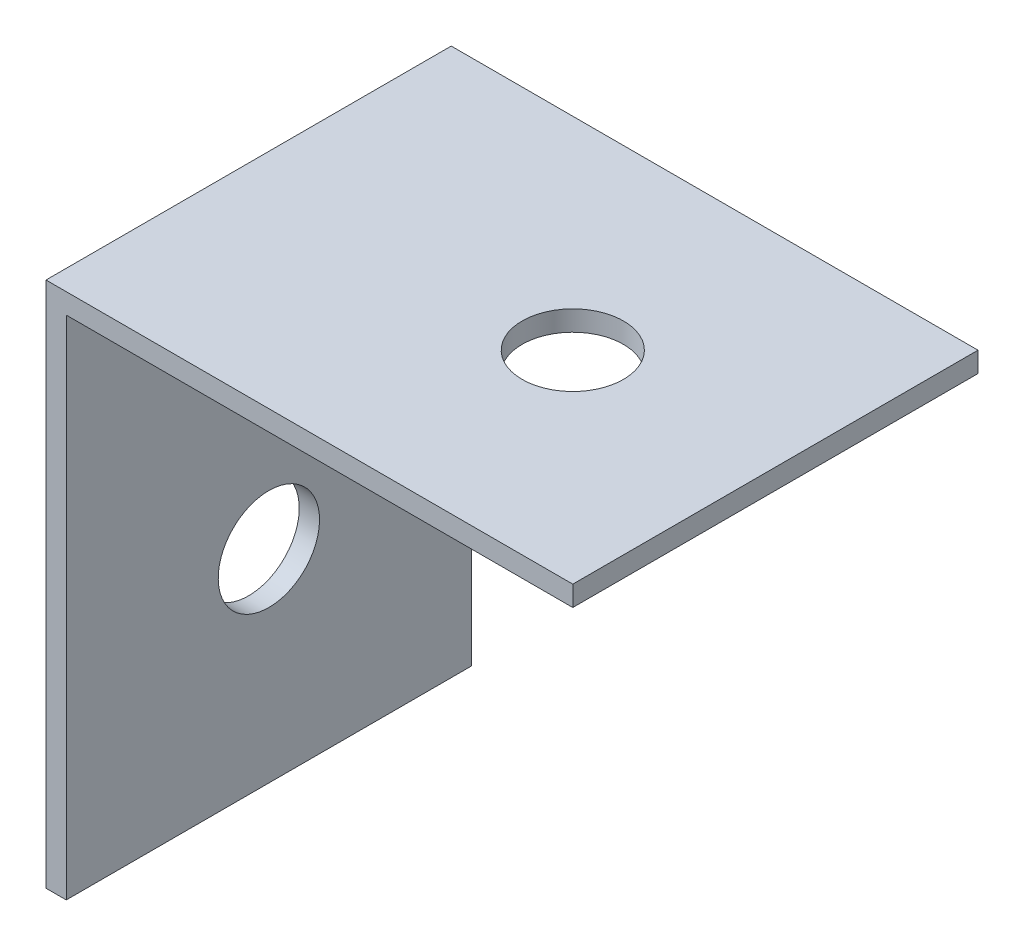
ISO-10303-21;
HEADER;
FILE_DESCRIPTION(('STEP AP214'),'2;1');
FILE_NAME('part.step','',(''),(''),'','','');
FILE_SCHEMA(('AUTOMOTIVE_DESIGN { 1 0 10303 214 1 1 1 1 }'));
ENDSEC;
DATA;
#1=APPLICATION_CONTEXT('core data for automotive mechanical design processes');
#2=APPLICATION_PROTOCOL_DEFINITION('international standard','automotive_design',2000,#1);
#3=PRODUCT_CONTEXT('',#1,'mechanical');
#4=PRODUCT('Part','Part','',(#3));
#5=PRODUCT_RELATED_PRODUCT_CATEGORY('part','',(#4));
#6=PRODUCT_DEFINITION_FORMATION('','',#4);
#7=PRODUCT_DEFINITION_CONTEXT('part definition',#1,'design');
#8=PRODUCT_DEFINITION('design','',#6,#7);
#9=PRODUCT_DEFINITION_SHAPE('','',#8);
#10=(LENGTH_UNIT() NAMED_UNIT(*) SI_UNIT(.MILLI.,.METRE.));
#11=(NAMED_UNIT(*) PLANE_ANGLE_UNIT() SI_UNIT($,.RADIAN.));
#12=(NAMED_UNIT(*) SI_UNIT($,.STERADIAN.) SOLID_ANGLE_UNIT());
#13=UNCERTAINTY_MEASURE_WITH_UNIT(LENGTH_MEASURE(1.E-05),#10,'distance_accuracy_value','');
#14=(GEOMETRIC_REPRESENTATION_CONTEXT(3) GLOBAL_UNCERTAINTY_ASSIGNED_CONTEXT((#13)) GLOBAL_UNIT_ASSIGNED_CONTEXT((#10,
#11,#12)) REPRESENTATION_CONTEXT('',''));
#15=CARTESIAN_POINT('',(0.,0.,0.));
#16=DIRECTION('',(0.,0.,1.));
#17=DIRECTION('',(1.,0.,0.));
#18=AXIS2_PLACEMENT_3D('',#15,#16,#17);
#19=CARTESIAN_POINT('',(-1.,0.,10.));
#20=DIRECTION('',(1.,0.,0.));
#21=DIRECTION('',(0.,1.,0.));
#22=AXIS2_PLACEMENT_3D('',#19,#20,#21);
#23=PLANE('',#22);
#24=CARTESIAN_POINT('',(-0.999999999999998,-15.,0.));
#25=DIRECTION('',(1.,0.,0.));
#26=DIRECTION('',(0.,1.,0.));
#27=AXIS2_PLACEMENT_3D('',#24,#25,#26);
#28=CIRCLE('',#27,2.5);
#29=CARTESIAN_POINT('',(-0.999999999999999,-12.5,0.));
#30=VERTEX_POINT('',#29);
#31=EDGE_CURVE('E164',#30,#30,#28,.F.);
#32=ORIENTED_EDGE('',*,*,#31,.F.);
#33=EDGE_LOOP('',(#32));
#34=FACE_BOUND('',#33,.T.);
#35=DIRECTION('',(0.,0.,-1.));
#36=VECTOR('',#35,1.);
#37=CARTESIAN_POINT('',(-1.,1.,10.));
#38=LINE('',#37,#36);
#39=CARTESIAN_POINT('',(-1.,1.,10.));
#40=VERTEX_POINT('',#39);
#41=CARTESIAN_POINT('',(-1.,1.,-10.));
#42=VERTEX_POINT('',#41);
#43=EDGE_CURVE('E100',#40,#42,#38,.T.);
#44=ORIENTED_EDGE('',*,*,#43,.T.);
#45=DIRECTION('',(0.,-1.,0.));
#46=VECTOR('',#45,1.);
#47=CARTESIAN_POINT('',(-1.,0.,-10.));
#48=LINE('',#47,#46);
#49=CARTESIAN_POINT('',(-0.999999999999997,-25.,-10.));
#50=VERTEX_POINT('',#49);
#51=EDGE_CURVE('E94',#42,#50,#48,.T.);
#52=ORIENTED_EDGE('',*,*,#51,.T.);
#53=DIRECTION('',(0.,0.,-1.));
#54=VECTOR('',#53,1.);
#55=CARTESIAN_POINT('',(-0.999999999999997,-25.,10.));
#56=LINE('',#55,#54);
#57=CARTESIAN_POINT('',(-0.999999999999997,-25.,10.));
#58=VERTEX_POINT('',#57);
#59=EDGE_CURVE('E11',#58,#50,#56,.T.);
#60=ORIENTED_EDGE('',*,*,#59,.F.);
#61=DIRECTION('',(0.,-1.,0.));
#62=VECTOR('',#61,1.);
#63=CARTESIAN_POINT('',(-1.,0.,10.));
#64=LINE('',#63,#62);
#65=EDGE_CURVE('E116',#40,#58,#64,.T.);
#66=ORIENTED_EDGE('',*,*,#65,.F.);
#67=EDGE_LOOP('',(#44,#52,#60,#66));
#68=FACE_BOUND('',#67,.T.);
#69=ADVANCED_FACE('F28',(#34,#68),#23,.F.);
#70=CARTESIAN_POINT('',(0.,-25.,10.));
#71=DIRECTION('',(0.,-1.,0.));
#72=DIRECTION('',(0.,0.,-1.));
#73=AXIS2_PLACEMENT_3D('',#70,#71,#72);
#74=PLANE('',#73);
#75=ORIENTED_EDGE('',*,*,#59,.T.);
#76=DIRECTION('',(-1.,0.,0.));
#77=VECTOR('',#76,1.);
#78=CARTESIAN_POINT('',(0.,-25.,-10.));
#79=LINE('',#78,#77);
#80=CARTESIAN_POINT('',(0.,-25.,-10.));
#81=VERTEX_POINT('',#80);
#82=EDGE_CURVE('E83',#81,#50,#79,.T.);
#83=ORIENTED_EDGE('',*,*,#82,.F.);
#84=DIRECTION('',(0.,0.,-1.));
#85=VECTOR('',#84,1.);
#86=CARTESIAN_POINT('',(0.,-25.,10.));
#87=LINE('',#86,#85);
#88=CARTESIAN_POINT('',(0.,-25.,10.));
#89=VERTEX_POINT('',#88);
#90=EDGE_CURVE('E35',#89,#81,#87,.T.);
#91=ORIENTED_EDGE('',*,*,#90,.F.);
#92=DIRECTION('',(-1.,0.,0.));
#93=VECTOR('',#92,1.);
#94=CARTESIAN_POINT('',(0.,-25.,10.));
#95=LINE('',#94,#93);
#96=EDGE_CURVE('E85',#89,#58,#95,.T.);
#97=ORIENTED_EDGE('',*,*,#96,.T.);
#98=EDGE_LOOP('',(#75,#83,#91,#97));
#99=FACE_BOUND('',#98,.T.);
#100=ADVANCED_FACE('F82',(#99),#74,.T.);
#101=CARTESIAN_POINT('',(0.,0.,10.));
#102=DIRECTION('',(1.,0.,0.));
#103=DIRECTION('',(0.,1.,0.));
#104=AXIS2_PLACEMENT_3D('',#101,#102,#103);
#105=PLANE('',#104);
#106=CARTESIAN_POINT('',(0.,-15.,0.));
#107=DIRECTION('',(1.,0.,0.));
#108=DIRECTION('',(0.,1.,0.));
#109=AXIS2_PLACEMENT_3D('',#106,#107,#108);
#110=CIRCLE('',#109,2.5);
#111=CARTESIAN_POINT('',(0.,-12.5,0.));
#112=VERTEX_POINT('',#111);
#113=EDGE_CURVE('E166',#112,#112,#110,.T.);
#114=ORIENTED_EDGE('',*,*,#113,.F.);
#115=EDGE_LOOP('',(#114));
#116=FACE_BOUND('',#115,.T.);
#117=ORIENTED_EDGE('',*,*,#90,.T.);
#118=DIRECTION('',(0.,-1.,0.));
#119=VECTOR('',#118,1.);
#120=CARTESIAN_POINT('',(0.,0.,-10.));
#121=LINE('',#120,#119);
#122=CARTESIAN_POINT('',(0.,0.,-10.));
#123=VERTEX_POINT('',#122);
#124=EDGE_CURVE('E98',#123,#81,#121,.T.);
#125=ORIENTED_EDGE('',*,*,#124,.F.);
#126=DIRECTION('',(0.,0.,-1.));
#127=VECTOR('',#126,1.);
#128=CARTESIAN_POINT('',(0.,0.,10.));
#129=LINE('',#128,#127);
#130=CARTESIAN_POINT('',(0.,0.,10.));
#131=VERTEX_POINT('',#130);
#132=EDGE_CURVE('E132',#131,#123,#129,.T.);
#133=ORIENTED_EDGE('',*,*,#132,.F.);
#134=DIRECTION('',(0.,-1.,0.));
#135=VECTOR('',#134,1.);
#136=CARTESIAN_POINT('',(0.,0.,10.));
#137=LINE('',#136,#135);
#138=EDGE_CURVE('E119',#131,#89,#137,.T.);
#139=ORIENTED_EDGE('',*,*,#138,.T.);
#140=EDGE_LOOP('',(#117,#125,#133,#139));
#141=FACE_BOUND('',#140,.T.);
#142=ADVANCED_FACE('F134',(#116,#141),#105,.T.);
#143=CARTESIAN_POINT('',(0.,0.,10.));
#144=DIRECTION('',(0.,-1.,0.));
#145=DIRECTION('',(0.,0.,-1.));
#146=AXIS2_PLACEMENT_3D('',#143,#144,#145);
#147=PLANE('',#146);
#148=CARTESIAN_POINT('',(15.,0.,0.));
#149=DIRECTION('',(0.,-1.,0.));
#150=DIRECTION('',(0.,0.,-1.));
#151=AXIS2_PLACEMENT_3D('',#148,#149,#150);
#152=CIRCLE('',#151,2.5);
#153=CARTESIAN_POINT('',(15.,0.,2.5));
#154=VERTEX_POINT('',#153);
#155=EDGE_CURVE('E104',#154,#154,#152,.F.);
#156=ORIENTED_EDGE('',*,*,#155,.T.);
#157=EDGE_LOOP('',(#156));
#158=FACE_BOUND('',#157,.T.);
#159=ORIENTED_EDGE('',*,*,#132,.T.);
#160=DIRECTION('',(-1.,0.,0.));
#161=VECTOR('',#160,1.);
#162=CARTESIAN_POINT('',(0.,0.,-10.));
#163=LINE('',#162,#161);
#164=CARTESIAN_POINT('',(25.,0.,-10.));
#165=VERTEX_POINT('',#164);
#166=EDGE_CURVE('E109',#165,#123,#163,.T.);
#167=ORIENTED_EDGE('',*,*,#166,.F.);
#168=DIRECTION('',(0.,0.,-1.));
#169=VECTOR('',#168,1.);
#170=CARTESIAN_POINT('',(25.,0.,10.));
#171=LINE('',#170,#169);
#172=CARTESIAN_POINT('',(25.,0.,10.));
#173=VERTEX_POINT('',#172);
#174=EDGE_CURVE('E130',#173,#165,#171,.T.);
#175=ORIENTED_EDGE('',*,*,#174,.F.);
#176=DIRECTION('',(-1.,0.,0.));
#177=VECTOR('',#176,1.);
#178=CARTESIAN_POINT('',(0.,0.,10.));
#179=LINE('',#178,#177);
#180=EDGE_CURVE('E122',#173,#131,#179,.T.);
#181=ORIENTED_EDGE('',*,*,#180,.T.);
#182=EDGE_LOOP('',(#159,#167,#175,#181));
#183=FACE_BOUND('',#182,.T.);
#184=ADVANCED_FACE('F139',(#158,#183),#147,.T.);
#185=CARTESIAN_POINT('',(25.,1.,10.));
#186=DIRECTION('',(1.,0.,0.));
#187=DIRECTION('',(0.,0.,-1.));
#188=AXIS2_PLACEMENT_3D('',#185,#186,#187);
#189=PLANE('',#188);
#190=ORIENTED_EDGE('',*,*,#174,.T.);
#191=DIRECTION('',(0.,-1.,0.));
#192=VECTOR('',#191,1.);
#193=CARTESIAN_POINT('',(25.,1.,-10.));
#194=LINE('',#193,#192);
#195=CARTESIAN_POINT('',(25.,1.,-10.));
#196=VERTEX_POINT('',#195);
#197=EDGE_CURVE('E111',#196,#165,#194,.T.);
#198=ORIENTED_EDGE('',*,*,#197,.F.);
#199=DIRECTION('',(0.,0.,-1.));
#200=VECTOR('',#199,1.);
#201=CARTESIAN_POINT('',(25.,1.,10.));
#202=LINE('',#201,#200);
#203=CARTESIAN_POINT('',(25.,1.,10.));
#204=VERTEX_POINT('',#203);
#205=EDGE_CURVE('E50',#204,#196,#202,.T.);
#206=ORIENTED_EDGE('',*,*,#205,.F.);
#207=DIRECTION('',(0.,-1.,0.));
#208=VECTOR('',#207,1.);
#209=CARTESIAN_POINT('',(25.,1.,10.));
#210=LINE('',#209,#208);
#211=EDGE_CURVE('E125',#204,#173,#210,.T.);
#212=ORIENTED_EDGE('',*,*,#211,.T.);
#213=EDGE_LOOP('',(#190,#198,#206,#212));
#214=FACE_BOUND('',#213,.T.);
#215=ADVANCED_FACE('F141',(#214),#189,.T.);
#216=CARTESIAN_POINT('',(0.,1.,10.));
#217=DIRECTION('',(0.,-1.,0.));
#218=DIRECTION('',(0.,0.,-1.));
#219=AXIS2_PLACEMENT_3D('',#216,#217,#218);
#220=PLANE('',#219);
#221=CARTESIAN_POINT('',(15.,1.,0.));
#222=DIRECTION('',(0.,1.,0.));
#223=DIRECTION('',(0.,0.,1.));
#224=AXIS2_PLACEMENT_3D('',#221,#222,#223);
#225=CIRCLE('',#224,2.5);
#226=CARTESIAN_POINT('',(15.,0.999999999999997,2.5));
#227=VERTEX_POINT('',#226);
#228=EDGE_CURVE('E101',#227,#227,#225,.T.);
#229=ORIENTED_EDGE('',*,*,#228,.F.);
#230=EDGE_LOOP('',(#229));
#231=FACE_BOUND('',#230,.T.);
#232=ORIENTED_EDGE('',*,*,#205,.T.);
#233=DIRECTION('',(1.,0.,0.));
#234=VECTOR('',#233,1.);
#235=CARTESIAN_POINT('',(0.,1.,-10.));
#236=LINE('',#235,#234);
#237=EDGE_CURVE('E114',#196,#42,#236,.F.);
#238=ORIENTED_EDGE('',*,*,#237,.T.);
#239=ORIENTED_EDGE('',*,*,#43,.F.);
#240=DIRECTION('',(1.,0.,0.));
#241=VECTOR('',#240,1.);
#242=CARTESIAN_POINT('',(0.,1.,10.));
#243=LINE('',#242,#241);
#244=EDGE_CURVE('E42',#204,#40,#243,.F.);
#245=ORIENTED_EDGE('',*,*,#244,.F.);
#246=EDGE_LOOP('',(#232,#238,#239,#245));
#247=FACE_BOUND('',#246,.T.);
#248=ADVANCED_FACE('F143',(#231,#247),#220,.F.);
#249=CARTESIAN_POINT('',(-0.999999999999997,-25.,10.));
#250=DIRECTION('',(0.,0.,-1.));
#251=DIRECTION('',(-1.,0.,0.));
#252=AXIS2_PLACEMENT_3D('',#249,#250,#251);
#253=PLANE('',#252);
#254=ORIENTED_EDGE('',*,*,#65,.T.);
#255=ORIENTED_EDGE('',*,*,#96,.F.);
#256=ORIENTED_EDGE('',*,*,#138,.F.);
#257=ORIENTED_EDGE('',*,*,#180,.F.);
#258=ORIENTED_EDGE('',*,*,#211,.F.);
#259=ORIENTED_EDGE('',*,*,#244,.T.);
#260=EDGE_LOOP('',(#254,#255,#256,#257,#258,#259));
#261=FACE_BOUND('',#260,.T.);
#262=ADVANCED_FACE('F136',(#261),#253,.F.);
#263=CARTESIAN_POINT('',(-0.999999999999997,-25.,-10.));
#264=DIRECTION('',(0.,0.,-1.));
#265=DIRECTION('',(-1.,0.,0.));
#266=AXIS2_PLACEMENT_3D('',#263,#264,#265);
#267=PLANE('',#266);
#268=ORIENTED_EDGE('',*,*,#51,.F.);
#269=ORIENTED_EDGE('',*,*,#237,.F.);
#270=ORIENTED_EDGE('',*,*,#197,.T.);
#271=ORIENTED_EDGE('',*,*,#166,.T.);
#272=ORIENTED_EDGE('',*,*,#124,.T.);
#273=ORIENTED_EDGE('',*,*,#82,.T.);
#274=EDGE_LOOP('',(#268,#269,#270,#271,#272,#273));
#275=FACE_BOUND('',#274,.T.);
#276=ADVANCED_FACE('F92',(#275),#267,.T.);
#277=CARTESIAN_POINT('',(15.,-25.001,0.));
#278=DIRECTION('',(0.,1.,0.));
#279=DIRECTION('',(0.,0.,1.));
#280=AXIS2_PLACEMENT_3D('',#277,#278,#279);
#281=CYLINDRICAL_SURFACE('',#280,2.5);
#282=CARTESIAN_POINT('',(15.,0.,2.5));
#283=CARTESIAN_POINT('',(15.,0.0104166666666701,2.5));
#284=CARTESIAN_POINT('',(15.,0.0208333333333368,2.5));
#285=CARTESIAN_POINT('',(15.,0.0416666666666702,2.5));
#286=CARTESIAN_POINT('',(15.,0.0520833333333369,2.5));
#287=CARTESIAN_POINT('',(15.,0.0729166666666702,2.5));
#288=CARTESIAN_POINT('',(15.,0.0833333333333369,2.5));
#289=CARTESIAN_POINT('',(15.,0.10416666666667,2.5));
#290=CARTESIAN_POINT('',(15.,0.114583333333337,2.5));
#291=CARTESIAN_POINT('',(15.,0.13541666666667,2.5));
#292=CARTESIAN_POINT('',(15.,0.145833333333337,2.5));
#293=CARTESIAN_POINT('',(15.,0.16666666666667,2.5));
#294=CARTESIAN_POINT('',(15.,0.177083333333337,2.5));
#295=CARTESIAN_POINT('',(15.,0.19791666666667,2.5));
#296=CARTESIAN_POINT('',(15.,0.208333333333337,2.5));
#297=CARTESIAN_POINT('',(15.,0.22916666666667,2.5));
#298=CARTESIAN_POINT('',(15.,0.239583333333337,2.5));
#299=CARTESIAN_POINT('',(15.,0.260416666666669,2.5));
#300=CARTESIAN_POINT('',(15.,0.270833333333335,2.5));
#301=CARTESIAN_POINT('',(15.,0.291666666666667,2.5));
#302=CARTESIAN_POINT('',(15.,0.302083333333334,2.5));
#303=CARTESIAN_POINT('',(15.,0.322916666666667,2.5));
#304=CARTESIAN_POINT('',(15.,0.333333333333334,2.5));
#305=CARTESIAN_POINT('',(15.,0.354166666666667,2.5));
#306=CARTESIAN_POINT('',(15.,0.364583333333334,2.5));
#307=CARTESIAN_POINT('',(15.,0.385416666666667,2.5));
#308=CARTESIAN_POINT('',(15.,0.395833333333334,2.5));
#309=CARTESIAN_POINT('',(15.,0.416666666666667,2.5));
#310=CARTESIAN_POINT('',(15.,0.427083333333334,2.5));
#311=CARTESIAN_POINT('',(15.,0.447916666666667,2.5));
#312=CARTESIAN_POINT('',(15.,0.458333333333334,2.5));
#313=CARTESIAN_POINT('',(15.,0.479166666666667,2.5));
#314=CARTESIAN_POINT('',(15.,0.489583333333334,2.5));
#315=CARTESIAN_POINT('',(15.,0.510416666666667,2.5));
#316=CARTESIAN_POINT('',(15.,0.520833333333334,2.5));
#317=CARTESIAN_POINT('',(15.,0.541666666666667,2.5));
#318=CARTESIAN_POINT('',(15.,0.552083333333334,2.5));
#319=CARTESIAN_POINT('',(15.,0.572916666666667,2.5));
#320=CARTESIAN_POINT('',(15.,0.583333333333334,2.5));
#321=CARTESIAN_POINT('',(15.,0.604166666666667,2.5));
#322=CARTESIAN_POINT('',(15.,0.614583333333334,2.5));
#323=CARTESIAN_POINT('',(15.,0.635416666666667,2.5));
#324=CARTESIAN_POINT('',(15.,0.645833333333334,2.5));
#325=CARTESIAN_POINT('',(15.,0.666666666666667,2.5));
#326=CARTESIAN_POINT('',(15.,0.677083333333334,2.5));
#327=CARTESIAN_POINT('',(15.,0.697916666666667,2.5));
#328=CARTESIAN_POINT('',(15.,0.708333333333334,2.5));
#329=CARTESIAN_POINT('',(15.,0.729166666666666,2.5));
#330=CARTESIAN_POINT('',(15.,0.739583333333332,2.5));
#331=CARTESIAN_POINT('',(15.,0.760416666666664,2.5));
#332=CARTESIAN_POINT('',(15.,0.77083333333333,2.5));
#333=CARTESIAN_POINT('',(15.,0.791666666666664,2.5));
#334=CARTESIAN_POINT('',(15.,0.802083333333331,2.5));
#335=CARTESIAN_POINT('',(15.,0.822916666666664,2.5));
#336=CARTESIAN_POINT('',(15.,0.833333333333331,2.5));
#337=CARTESIAN_POINT('',(15.,0.854166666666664,2.5));
#338=CARTESIAN_POINT('',(15.,0.864583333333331,2.5));
#339=CARTESIAN_POINT('',(15.,0.885416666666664,2.5));
#340=CARTESIAN_POINT('',(15.,0.895833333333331,2.5));
#341=CARTESIAN_POINT('',(15.,0.916666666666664,2.5));
#342=CARTESIAN_POINT('',(15.,0.927083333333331,2.5));
#343=CARTESIAN_POINT('',(15.,0.947916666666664,2.5));
#344=CARTESIAN_POINT('',(15.,0.958333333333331,2.5));
#345=CARTESIAN_POINT('',(15.,0.979166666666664,2.5));
#346=CARTESIAN_POINT('',(15.,0.989583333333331,2.5));
#347=CARTESIAN_POINT('',(15.,0.999999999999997,2.5));
#348=B_SPLINE_CURVE_WITH_KNOTS('',3,(#282,#283,#284,#285,#286,#287,#288,#289,#290,#291,#292,
#293,#294,#295,#296,#297,#298,#299,#300,#301,#302,#303,#304,#305,#306,#307,#308,#309,#310,#311,
#312,#313,#314,#315,#316,#317,#318,#319,#320,#321,#322,#323,#324,#325,#326,#327,#328,#329,#330,
#331,#332,#333,#334,#335,#336,#337,#338,#339,#340,#341,#342,#343,#344,#345,#346,#347),
.UNSPECIFIED.,.F.,.F.,(4,2,2,2,2,2,2,2,2,2,2,2,2,2,2,2,2,2,2,2,2,2,2,2,2,2,2,2,2,2,2,2,4),(0.,
0.03125,0.0625000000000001,0.0937500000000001,0.125,0.15625,0.1875,0.21875,0.25,
0.281249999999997,0.312499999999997,0.343749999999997,0.374999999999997,0.406249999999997,
0.437499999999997,0.468749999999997,0.499999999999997,0.531249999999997,0.562499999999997,
0.593749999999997,0.624999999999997,0.656249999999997,0.687499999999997,0.718749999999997,
0.749999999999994,0.781249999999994,0.812499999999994,0.843749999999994,0.874999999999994,
0.906249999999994,0.937499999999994,0.968749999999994,0.999999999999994),.UNSPECIFIED.);
#349=EDGE_CURVE('BSEAM186',#154,#227,#348,.T.);
#350=ORIENTED_EDGE('',*,*,#155,.F.);
#351=ORIENTED_EDGE('',*,*,#228,.T.);
#352=ORIENTED_EDGE('',*,*,#349,.T.);
#353=ORIENTED_EDGE('',*,*,#349,.F.);
#354=EDGE_LOOP('',(#350,#352,#351,#353));
#355=FACE_BOUND('',#354,.T.);
#356=ADVANCED_FACE('F186',(#355),#281,.F.);
#357=CARTESIAN_POINT('',(-1.001,-15.,0.));
#358=DIRECTION('',(1.,0.,0.));
#359=DIRECTION('',(0.,1.,0.));
#360=AXIS2_PLACEMENT_3D('',#357,#358,#359);
#361=CYLINDRICAL_SURFACE('',#360,2.5);
#362=CARTESIAN_POINT('',(0.,-12.5,0.));
#363=CARTESIAN_POINT('',(-0.0104166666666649,-12.5,0.));
#364=CARTESIAN_POINT('',(-0.0208333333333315,-12.5,0.));
#365=CARTESIAN_POINT('',(-0.0416666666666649,-12.5,0.));
#366=CARTESIAN_POINT('',(-0.0520833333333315,-12.5,0.));
#367=CARTESIAN_POINT('',(-0.0729166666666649,-12.5,0.));
#368=CARTESIAN_POINT('',(-0.0833333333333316,-12.5,0.));
#369=CARTESIAN_POINT('',(-0.104166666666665,-12.5,0.));
#370=CARTESIAN_POINT('',(-0.114583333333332,-12.5,0.));
#371=CARTESIAN_POINT('',(-0.135416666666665,-12.5,0.));
#372=CARTESIAN_POINT('',(-0.145833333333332,-12.5,0.));
#373=CARTESIAN_POINT('',(-0.166666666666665,-12.5,0.));
#374=CARTESIAN_POINT('',(-0.177083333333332,-12.5,0.));
#375=CARTESIAN_POINT('',(-0.197916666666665,-12.5,0.));
#376=CARTESIAN_POINT('',(-0.208333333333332,-12.5,0.));
#377=CARTESIAN_POINT('',(-0.229166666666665,-12.5,0.));
#378=CARTESIAN_POINT('',(-0.239583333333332,-12.5,0.));
#379=CARTESIAN_POINT('',(-0.260416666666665,-12.5,0.));
#380=CARTESIAN_POINT('',(-0.270833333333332,-12.5,0.));
#381=CARTESIAN_POINT('',(-0.291666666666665,-12.5,0.));
#382=CARTESIAN_POINT('',(-0.302083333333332,-12.5,0.));
#383=CARTESIAN_POINT('',(-0.322916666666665,-12.5,0.));
#384=CARTESIAN_POINT('',(-0.333333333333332,-12.5,0.));
#385=CARTESIAN_POINT('',(-0.354166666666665,-12.5,0.));
#386=CARTESIAN_POINT('',(-0.364583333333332,-12.5,0.));
#387=CARTESIAN_POINT('',(-0.385416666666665,-12.5,0.));
#388=CARTESIAN_POINT('',(-0.395833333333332,-12.5,0.));
#389=CARTESIAN_POINT('',(-0.416666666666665,-12.5,0.));
#390=CARTESIAN_POINT('',(-0.427083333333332,-12.5,0.));
#391=CARTESIAN_POINT('',(-0.447916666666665,-12.5,0.));
#392=CARTESIAN_POINT('',(-0.458333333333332,-12.5,0.));
#393=CARTESIAN_POINT('',(-0.479166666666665,-12.5,0.));
#394=CARTESIAN_POINT('',(-0.489583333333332,-12.5,0.));
#395=CARTESIAN_POINT('',(-0.510416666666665,-12.5,0.));
#396=CARTESIAN_POINT('',(-0.520833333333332,-12.5,0.));
#397=CARTESIAN_POINT('',(-0.541666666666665,-12.5,0.));
#398=CARTESIAN_POINT('',(-0.552083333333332,-12.5,0.));
#399=CARTESIAN_POINT('',(-0.572916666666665,-12.5,0.));
#400=CARTESIAN_POINT('',(-0.583333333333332,-12.5,0.));
#401=CARTESIAN_POINT('',(-0.604166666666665,-12.5,0.));
#402=CARTESIAN_POINT('',(-0.614583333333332,-12.5,0.));
#403=CARTESIAN_POINT('',(-0.635416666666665,-12.5,0.));
#404=CARTESIAN_POINT('',(-0.645833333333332,-12.5,0.));
#405=CARTESIAN_POINT('',(-0.666666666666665,-12.5,0.));
#406=CARTESIAN_POINT('',(-0.677083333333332,-12.5,0.));
#407=CARTESIAN_POINT('',(-0.697916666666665,-12.5,0.));
#408=CARTESIAN_POINT('',(-0.708333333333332,-12.5,0.));
#409=CARTESIAN_POINT('',(-0.729166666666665,-12.5,0.));
#410=CARTESIAN_POINT('',(-0.739583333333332,-12.5,0.));
#411=CARTESIAN_POINT('',(-0.760416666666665,-12.5,0.));
#412=CARTESIAN_POINT('',(-0.770833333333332,-12.5,0.));
#413=CARTESIAN_POINT('',(-0.791666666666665,-12.5,0.));
#414=CARTESIAN_POINT('',(-0.802083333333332,-12.5,0.));
#415=CARTESIAN_POINT('',(-0.822916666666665,-12.5,0.));
#416=CARTESIAN_POINT('',(-0.833333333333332,-12.5,0.));
#417=CARTESIAN_POINT('',(-0.854166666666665,-12.5,0.));
#418=CARTESIAN_POINT('',(-0.864583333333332,-12.5,0.));
#419=CARTESIAN_POINT('',(-0.885416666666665,-12.5,0.));
#420=CARTESIAN_POINT('',(-0.895833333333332,-12.5,0.));
#421=CARTESIAN_POINT('',(-0.916666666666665,-12.5,0.));
#422=CARTESIAN_POINT('',(-0.927083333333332,-12.5,0.));
#423=CARTESIAN_POINT('',(-0.947916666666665,-12.5,0.));
#424=CARTESIAN_POINT('',(-0.958333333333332,-12.5,0.));
#425=CARTESIAN_POINT('',(-0.979166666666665,-12.5,0.));
#426=CARTESIAN_POINT('',(-0.989583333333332,-12.5,0.));
#427=CARTESIAN_POINT('',(-0.999999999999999,-12.5,0.));
#428=B_SPLINE_CURVE_WITH_KNOTS('',3,(#362,#363,#364,#365,#366,#367,#368,#369,#370,#371,#372,
#373,#374,#375,#376,#377,#378,#379,#380,#381,#382,#383,#384,#385,#386,#387,#388,#389,#390,#391,
#392,#393,#394,#395,#396,#397,#398,#399,#400,#401,#402,#403,#404,#405,#406,#407,#408,#409,#410,
#411,#412,#413,#414,#415,#416,#417,#418,#419,#420,#421,#422,#423,#424,#425,#426,#427),
.UNSPECIFIED.,.F.,.F.,(4,2,2,2,2,2,2,2,2,2,2,2,2,2,2,2,2,2,2,2,2,2,2,2,2,2,2,2,2,2,2,2,4),(0.,
0.0312499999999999,0.0624999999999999,0.09375,0.125,0.15625,0.1875,0.21875,0.25,0.28125,0.3125,
0.34375,0.375,0.40625,0.4375,0.46875,0.5,0.53125,0.5625,0.59375,0.625,0.65625,0.6875,0.71875,
0.75,0.78125,0.8125,0.84375,0.875,0.90625,0.9375,0.96875,1.),.UNSPECIFIED.);
#429=EDGE_CURVE('BSEAM173',#112,#30,#428,.T.);
#430=ORIENTED_EDGE('',*,*,#113,.T.);
#431=ORIENTED_EDGE('',*,*,#31,.T.);
#432=ORIENTED_EDGE('',*,*,#429,.T.);
#433=ORIENTED_EDGE('',*,*,#429,.F.);
#434=EDGE_LOOP('',(#430,#432,#431,#433));
#435=FACE_BOUND('',#434,.T.);
#436=ADVANCED_FACE('F173',(#435),#361,.F.);
#437=CLOSED_SHELL('',(#69,#100,#142,#184,#215,#248,#262,#276,#356,#436));
#438=MANIFOLD_SOLID_BREP('B2',#437);
#439=ADVANCED_BREP_SHAPE_REPRESENTATION('',(#18,#438),#14);
#440=SHAPE_DEFINITION_REPRESENTATION(#9,#439);
ENDSEC;
END-ISO-10303-21;
